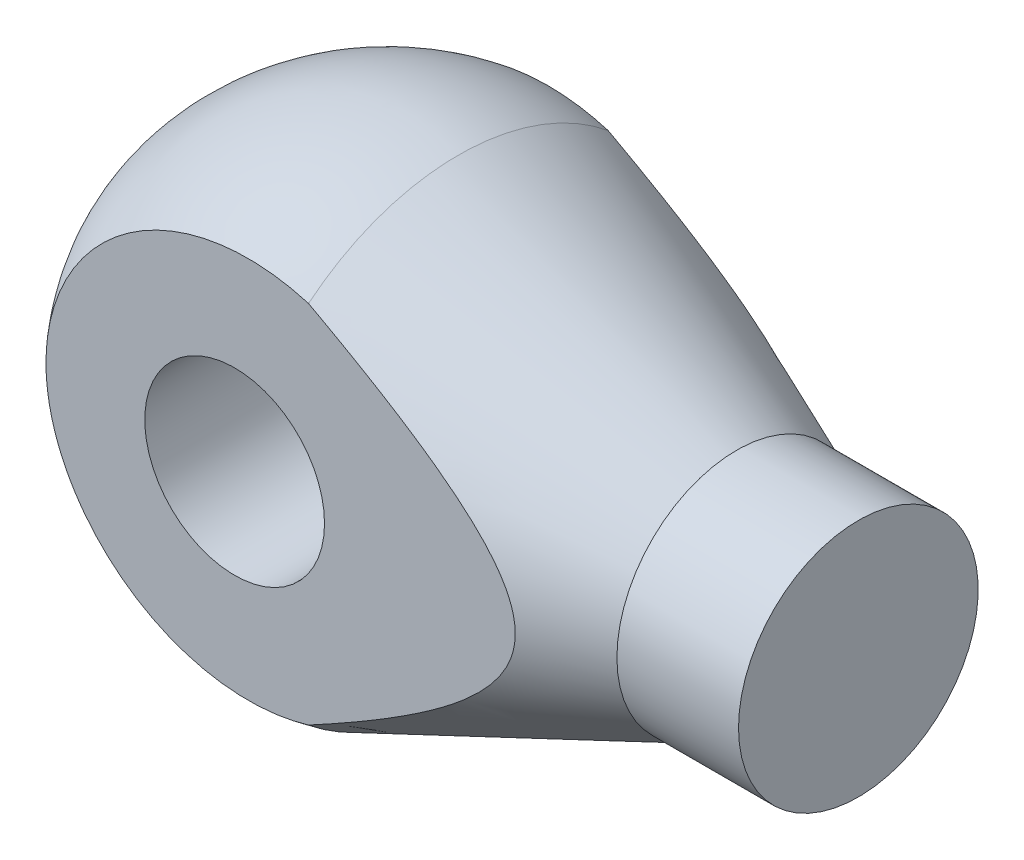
from build123d import *

# Parameters (mm, degrees)
SKETCH_2_R               = 15
CUT_EXTRUDE_1_DEPTH      = 50
CUT_EXTRUDE_3_DEPTH      = 27
CUT_EXTRUDE_3_DEPTH_BACK = 61
SKETCH_3_W               = 30.993027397
SKETCH_3_H               = 95.826989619


with BuildPart() as part:
    # Sketch 1 → Revolve 1 (revolve)
    with BuildSketch(Plane(origin=(0, 0, 0), x_dir=(1, 0, 0), z_dir=(0, 1, 0)), mode=Mode.PRIVATE) as revolve_1_sk:
        with BuildLine():
            Line((56.296690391, 0), (56.296690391, 20))
            Line((56.296690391, 20), (35.998529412, 20))
            Line((35.998529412, 20), (-10.466042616, 39.409788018))
            ThreePointArc((-10.466042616, 39.409788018), (-46.606940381, 32.08536114), (-64.782234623, 0))
            Line((-64.782234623, 0), (56.296690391, 0))
        make_face()
    revolve(revolve_1_sk.sketch.rotate(Axis((-80.869117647, 0, 0), (1, 0, 0)), 180), axis=Axis((-80.869117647, 0, 0), (1, 0, 0)))

    # Sketch 2 → Cut-Extrude 1 (cut, symmetric)
    with BuildSketch(Plane.XY):
        with Locations(Location((-22.798896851, 0, 0), (0, 0, 34.695345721))):
            Circle(SKETCH_2_R)
    extrude(amount=CUT_EXTRUDE_1_DEPTH, both=True, mode=Mode.SUBTRACT)

    # Sketch 3 → Cut-Extrude 3 (cut, two sides: drawn at the far end of the back side and taken through both)
    with BuildSketch(Plane(origin=(0, 0, 0), x_dir=(0, 0, -1), z_dir=(1, 0, 0)).offset(-CUT_EXTRUDE_3_DEPTH_BACK)):
        with Locations((-40.496513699, -0.087274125)):
            Rectangle(SKETCH_3_W, SKETCH_3_H)
        with Locations((40.496513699, -0.087274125)):
            Rectangle(SKETCH_3_W, SKETCH_3_H)
    extrude(amount=CUT_EXTRUDE_3_DEPTH + CUT_EXTRUDE_3_DEPTH_BACK, mode=Mode.SUBTRACT)


solid = part.part
